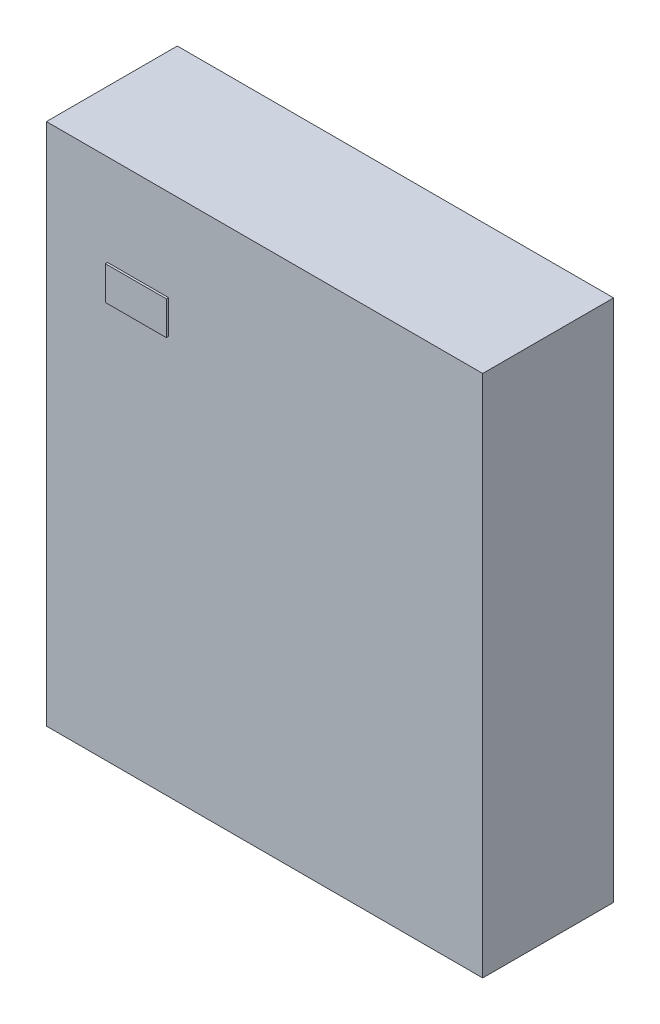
ISO-10303-21;
HEADER;
FILE_DESCRIPTION(('STEP AP214'),'2;1');
FILE_NAME('part.step','',(''),(''),'','','');
FILE_SCHEMA(('AUTOMOTIVE_DESIGN { 1 0 10303 214 1 1 1 1 }'));
ENDSEC;
DATA;
#1=APPLICATION_CONTEXT('core data for automotive mechanical design processes');
#2=APPLICATION_PROTOCOL_DEFINITION('international standard','automotive_design',2000,#1);
#3=PRODUCT_CONTEXT('',#1,'mechanical');
#4=PRODUCT('Part','Part','',(#3));
#5=PRODUCT_RELATED_PRODUCT_CATEGORY('part','',(#4));
#6=PRODUCT_DEFINITION_FORMATION('','',#4);
#7=PRODUCT_DEFINITION_CONTEXT('part definition',#1,'design');
#8=PRODUCT_DEFINITION('design','',#6,#7);
#9=PRODUCT_DEFINITION_SHAPE('','',#8);
#10=(LENGTH_UNIT() NAMED_UNIT(*) SI_UNIT(.MILLI.,.METRE.));
#11=(NAMED_UNIT(*) PLANE_ANGLE_UNIT() SI_UNIT($,.RADIAN.));
#12=(NAMED_UNIT(*) SI_UNIT($,.STERADIAN.) SOLID_ANGLE_UNIT());
#13=UNCERTAINTY_MEASURE_WITH_UNIT(LENGTH_MEASURE(1.E-05),#10,'distance_accuracy_value','');
#14=(GEOMETRIC_REPRESENTATION_CONTEXT(3) GLOBAL_UNCERTAINTY_ASSIGNED_CONTEXT((#13)) GLOBAL_UNIT_ASSIGNED_CONTEXT((#10,
#11,#12)) REPRESENTATION_CONTEXT('',''));
#15=CARTESIAN_POINT('',(0.,0.,0.));
#16=DIRECTION('',(0.,0.,1.));
#17=DIRECTION('',(1.,0.,0.));
#18=AXIS2_PLACEMENT_3D('',#15,#16,#17);
#19=CARTESIAN_POINT('',(-500.,1200.,300.));
#20=DIRECTION('',(0.,0.,-1.));
#21=DIRECTION('',(-1.,0.,0.));
#22=AXIS2_PLACEMENT_3D('',#19,#20,#21);
#23=PLANE('',#22);
#24=DIRECTION('',(1.,0.,0.));
#25=VECTOR('',#24,1.);
#26=CARTESIAN_POINT('',(-500.,0.,300.));
#27=LINE('',#26,#25);
#28=CARTESIAN_POINT('',(-500.,0.,300.));
#29=VERTEX_POINT('',#28);
#30=CARTESIAN_POINT('',(500.,0.,300.));
#31=VERTEX_POINT('',#30);
#32=EDGE_CURVE('E388',#29,#31,#27,.T.);
#33=ORIENTED_EDGE('',*,*,#32,.T.);
#34=DIRECTION('',(0.,-1.,0.));
#35=VECTOR('',#34,1.);
#36=CARTESIAN_POINT('',(500.,1200.,300.));
#37=LINE('',#36,#35);
#38=CARTESIAN_POINT('',(500.,1200.,300.));
#39=VERTEX_POINT('',#38);
#40=EDGE_CURVE('E40',#39,#31,#37,.T.);
#41=ORIENTED_EDGE('',*,*,#40,.F.);
#42=DIRECTION('',(1.,0.,0.));
#43=VECTOR('',#42,1.);
#44=CARTESIAN_POINT('',(-500.,1200.,300.));
#45=LINE('',#44,#43);
#46=CARTESIAN_POINT('',(-500.,1200.,300.));
#47=VERTEX_POINT('',#46);
#48=EDGE_CURVE('E397',#47,#39,#45,.T.);
#49=ORIENTED_EDGE('',*,*,#48,.F.);
#50=DIRECTION('',(0.,-1.,0.));
#51=VECTOR('',#50,1.);
#52=CARTESIAN_POINT('',(-500.,1200.,300.));
#53=LINE('',#52,#51);
#54=EDGE_CURVE('E11',#47,#29,#53,.T.);
#55=ORIENTED_EDGE('',*,*,#54,.T.);
#56=EDGE_LOOP('',(#33,#41,#49,#55));
#57=FACE_BOUND('',#56,.T.);
#58=DIRECTION('',(0.,-1.,0.));
#59=VECTOR('',#58,1.);
#60=CARTESIAN_POINT('',(-360.,990.5,300.));
#61=LINE('',#60,#59);
#62=CARTESIAN_POINT('',(-360.,990.5,300.));
#63=VERTEX_POINT('',#62);
#64=CARTESIAN_POINT('',(-360.,913.5,300.));
#65=VERTEX_POINT('',#64);
#66=EDGE_CURVE('E201',#63,#65,#61,.T.);
#67=ORIENTED_EDGE('',*,*,#66,.F.);
#68=DIRECTION('',(-1.,0.,0.));
#69=VECTOR('',#68,1.);
#70=CARTESIAN_POINT('',(-360.,990.5,300.));
#71=LINE('',#70,#69);
#72=CARTESIAN_POINT('',(-220.,990.5,300.));
#73=VERTEX_POINT('',#72);
#74=EDGE_CURVE('E203',#73,#63,#71,.T.);
#75=ORIENTED_EDGE('',*,*,#74,.F.);
#76=DIRECTION('',(0.,1.,0.));
#77=VECTOR('',#76,1.);
#78=CARTESIAN_POINT('',(-220.,990.5,300.));
#79=LINE('',#78,#77);
#80=CARTESIAN_POINT('',(-220.,913.5,300.));
#81=VERTEX_POINT('',#80);
#82=EDGE_CURVE('E52',#81,#73,#79,.T.);
#83=ORIENTED_EDGE('',*,*,#82,.F.);
#84=DIRECTION('',(1.,0.,0.));
#85=VECTOR('',#84,1.);
#86=CARTESIAN_POINT('',(-360.,913.5,300.));
#87=LINE('',#86,#85);
#88=EDGE_CURVE('E47',#65,#81,#87,.T.);
#89=ORIENTED_EDGE('',*,*,#88,.F.);
#90=EDGE_LOOP('',(#67,#75,#83,#89));
#91=FACE_BOUND('',#90,.T.);
#92=ADVANCED_FACE('F32',(#57,#91),#23,.F.);
#93=CARTESIAN_POINT('',(-500.,1200.,0.));
#94=DIRECTION('',(1.,0.,0.));
#95=DIRECTION('',(0.,0.,-1.));
#96=AXIS2_PLACEMENT_3D('',#93,#94,#95);
#97=PLANE('',#96);
#98=DIRECTION('',(0.,0.,1.));
#99=VECTOR('',#98,1.);
#100=CARTESIAN_POINT('',(-500.,0.,0.));
#101=LINE('',#100,#99);
#102=CARTESIAN_POINT('',(-500.,0.,0.));
#103=VERTEX_POINT('',#102);
#104=EDGE_CURVE('E385',#103,#29,#101,.T.);
#105=ORIENTED_EDGE('',*,*,#104,.T.);
#106=ORIENTED_EDGE('',*,*,#54,.F.);
#107=DIRECTION('',(0.,0.,1.));
#108=VECTOR('',#107,1.);
#109=CARTESIAN_POINT('',(-500.,1200.,0.));
#110=LINE('',#109,#108);
#111=CARTESIAN_POINT('',(-500.,1200.,0.));
#112=VERTEX_POINT('',#111);
#113=EDGE_CURVE('E394',#112,#47,#110,.T.);
#114=ORIENTED_EDGE('',*,*,#113,.F.);
#115=DIRECTION('',(0.,-1.,0.));
#116=VECTOR('',#115,1.);
#117=CARTESIAN_POINT('',(-500.,1200.,0.));
#118=LINE('',#117,#116);
#119=EDGE_CURVE('E403',#112,#103,#118,.T.);
#120=ORIENTED_EDGE('',*,*,#119,.T.);
#121=EDGE_LOOP('',(#105,#106,#114,#120));
#122=FACE_BOUND('',#121,.T.);
#123=ADVANCED_FACE('F34',(#122),#97,.F.);
#124=CARTESIAN_POINT('',(500.,1200.,0.));
#125=DIRECTION('',(-1.,0.,0.));
#126=DIRECTION('',(0.,0.,1.));
#127=AXIS2_PLACEMENT_3D('',#124,#125,#126);
#128=PLANE('',#127);
#129=DIRECTION('',(0.,0.,-1.));
#130=VECTOR('',#129,1.);
#131=CARTESIAN_POINT('',(500.,0.,0.));
#132=LINE('',#131,#130);
#133=CARTESIAN_POINT('',(500.,0.,0.));
#134=VERTEX_POINT('',#133);
#135=EDGE_CURVE('E390',#31,#134,#132,.T.);
#136=ORIENTED_EDGE('',*,*,#135,.T.);
#137=DIRECTION('',(0.,-1.,0.));
#138=VECTOR('',#137,1.);
#139=CARTESIAN_POINT('',(500.,1200.,0.));
#140=LINE('',#139,#138);
#141=CARTESIAN_POINT('',(500.,1200.,0.));
#142=VERTEX_POINT('',#141);
#143=EDGE_CURVE('E406',#142,#134,#140,.T.);
#144=ORIENTED_EDGE('',*,*,#143,.F.);
#145=DIRECTION('',(0.,0.,-1.));
#146=VECTOR('',#145,1.);
#147=CARTESIAN_POINT('',(500.,1200.,0.));
#148=LINE('',#147,#146);
#149=EDGE_CURVE('E399',#39,#142,#148,.T.);
#150=ORIENTED_EDGE('',*,*,#149,.F.);
#151=ORIENTED_EDGE('',*,*,#40,.T.);
#152=EDGE_LOOP('',(#136,#144,#150,#151));
#153=FACE_BOUND('',#152,.T.);
#154=ADVANCED_FACE('F413',(#153),#128,.F.);
#155=CARTESIAN_POINT('',(-500.,1200.,0.));
#156=DIRECTION('',(0.,0.,1.));
#157=DIRECTION('',(1.,0.,0.));
#158=AXIS2_PLACEMENT_3D('',#155,#156,#157);
#159=PLANE('',#158);
#160=CARTESIAN_POINT('',(477.5,1177.5,0.));
#161=DIRECTION('',(0.,0.,-1.));
#162=DIRECTION('',(-1.,0.,0.));
#163=AXIS2_PLACEMENT_3D('',#160,#161,#162);
#164=CIRCLE('',#163,5.);
#165=CARTESIAN_POINT('',(472.5,1177.5,0.));
#166=VERTEX_POINT('',#165);
#167=EDGE_CURVE('E364',#166,#166,#164,.T.);
#168=ORIENTED_EDGE('',*,*,#167,.F.);
#169=EDGE_LOOP('',(#168));
#170=FACE_BOUND('',#169,.T.);
#171=CARTESIAN_POINT('',(-477.5,1177.5,0.));
#172=DIRECTION('',(0.,0.,-1.));
#173=DIRECTION('',(-1.,0.,0.));
#174=AXIS2_PLACEMENT_3D('',#171,#172,#173);
#175=CIRCLE('',#174,5.);
#176=CARTESIAN_POINT('',(-482.5,1177.5,0.));
#177=VERTEX_POINT('',#176);
#178=EDGE_CURVE('E370',#177,#177,#175,.T.);
#179=ORIENTED_EDGE('',*,*,#178,.F.);
#180=EDGE_LOOP('',(#179));
#181=FACE_BOUND('',#180,.T.);
#182=CARTESIAN_POINT('',(-477.5,22.5,0.));
#183=DIRECTION('',(0.,0.,-1.));
#184=DIRECTION('',(-1.,0.,0.));
#185=AXIS2_PLACEMENT_3D('',#182,#183,#184);
#186=CIRCLE('',#185,5.);
#187=CARTESIAN_POINT('',(-482.5,22.5,0.));
#188=VERTEX_POINT('',#187);
#189=EDGE_CURVE('E376',#188,#188,#186,.T.);
#190=ORIENTED_EDGE('',*,*,#189,.F.);
#191=EDGE_LOOP('',(#190));
#192=FACE_BOUND('',#191,.T.);
#193=CARTESIAN_POINT('',(477.5,22.5,0.));
#194=DIRECTION('',(0.,0.,-1.));
#195=DIRECTION('',(-1.,0.,0.));
#196=AXIS2_PLACEMENT_3D('',#193,#194,#195);
#197=CIRCLE('',#196,5.);
#198=CARTESIAN_POINT('',(472.5,22.5,0.));
#199=VERTEX_POINT('',#198);
#200=EDGE_CURVE('E382',#199,#199,#197,.T.);
#201=ORIENTED_EDGE('',*,*,#200,.F.);
#202=EDGE_LOOP('',(#201));
#203=FACE_BOUND('',#202,.T.);
#204=DIRECTION('',(-1.,0.,0.));
#205=VECTOR('',#204,1.);
#206=CARTESIAN_POINT('',(-500.,0.,0.));
#207=LINE('',#206,#205);
#208=EDGE_CURVE('E392',#134,#103,#207,.T.);
#209=ORIENTED_EDGE('',*,*,#208,.T.);
#210=ORIENTED_EDGE('',*,*,#119,.F.);
#211=DIRECTION('',(-1.,0.,0.));
#212=VECTOR('',#211,1.);
#213=CARTESIAN_POINT('',(-500.,1200.,0.));
#214=LINE('',#213,#212);
#215=EDGE_CURVE('E401',#142,#112,#214,.T.);
#216=ORIENTED_EDGE('',*,*,#215,.F.);
#217=ORIENTED_EDGE('',*,*,#143,.T.);
#218=EDGE_LOOP('',(#209,#210,#216,#217));
#219=FACE_BOUND('',#218,.T.);
#220=ADVANCED_FACE('F422',(#170,#181,#192,#203,#219),#159,.F.);
#221=CARTESIAN_POINT('',(-500.,1200.,300.));
#222=DIRECTION('',(0.,1.,0.));
#223=DIRECTION('',(0.,0.,1.));
#224=AXIS2_PLACEMENT_3D('',#221,#222,#223);
#225=PLANE('',#224);
#226=ORIENTED_EDGE('',*,*,#113,.T.);
#227=ORIENTED_EDGE('',*,*,#48,.T.);
#228=ORIENTED_EDGE('',*,*,#149,.T.);
#229=ORIENTED_EDGE('',*,*,#215,.T.);
#230=EDGE_LOOP('',(#226,#227,#228,#229));
#231=FACE_BOUND('',#230,.T.);
#232=ADVANCED_FACE('F428',(#231),#225,.T.);
#233=CARTESIAN_POINT('',(-500.,0.,300.));
#234=DIRECTION('',(0.,1.,0.));
#235=DIRECTION('',(0.,0.,1.));
#236=AXIS2_PLACEMENT_3D('',#233,#234,#235);
#237=PLANE('',#236);
#238=DIRECTION('',(0.,0.,1.));
#239=VECTOR('',#238,1.);
#240=CARTESIAN_POINT('',(-25.0000000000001,0.,70.));
#241=LINE('',#240,#239);
#242=CARTESIAN_POINT('',(-25.0000000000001,0.,70.));
#243=VERTEX_POINT('',#242);
#244=CARTESIAN_POINT('',(-25.0000000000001,0.,155.));
#245=VERTEX_POINT('',#244);
#246=EDGE_CURVE('E235',#243,#245,#241,.T.);
#247=ORIENTED_EDGE('',*,*,#246,.F.);
#248=CARTESIAN_POINT('',(-50.0000000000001,0.,70.));
#249=DIRECTION('',(0.,-1.,0.));
#250=DIRECTION('',(0.,0.,-1.));
#251=AXIS2_PLACEMENT_3D('',#248,#249,#250);
#252=CIRCLE('',#251,25.);
#253=CARTESIAN_POINT('',(-50.0000000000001,0.,45.));
#254=VERTEX_POINT('',#253);
#255=EDGE_CURVE('E233',#254,#243,#252,.T.);
#256=ORIENTED_EDGE('',*,*,#255,.F.);
#257=DIRECTION('',(1.,0.,0.));
#258=VECTOR('',#257,1.);
#259=CARTESIAN_POINT('',(-50.0000000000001,0.,45.));
#260=LINE('',#259,#258);
#261=CARTESIAN_POINT('',(-450.,0.,44.9999999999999));
#262=VERTEX_POINT('',#261);
#263=EDGE_CURVE('E253',#262,#254,#260,.T.);
#264=ORIENTED_EDGE('',*,*,#263,.F.);
#265=CARTESIAN_POINT('',(-450.,0.,69.9999999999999));
#266=DIRECTION('',(0.,-1.,0.));
#267=DIRECTION('',(0.,0.,1.));
#268=AXIS2_PLACEMENT_3D('',#265,#266,#267);
#269=CIRCLE('',#268,25.);
#270=CARTESIAN_POINT('',(-475.,0.,70.));
#271=VERTEX_POINT('',#270);
#272=EDGE_CURVE('E250',#271,#262,#269,.T.);
#273=ORIENTED_EDGE('',*,*,#272,.F.);
#274=DIRECTION('',(0.,0.,-1.));
#275=VECTOR('',#274,1.);
#276=CARTESIAN_POINT('',(-475.,0.,70.0000000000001));
#277=LINE('',#276,#275);
#278=CARTESIAN_POINT('',(-475.,0.,155.));
#279=VERTEX_POINT('',#278);
#280=EDGE_CURVE('E247',#279,#271,#277,.T.);
#281=ORIENTED_EDGE('',*,*,#280,.F.);
#282=CARTESIAN_POINT('',(-450.,0.,155.));
#283=DIRECTION('',(0.,-1.,0.));
#284=DIRECTION('',(0.,0.,-1.));
#285=AXIS2_PLACEMENT_3D('',#282,#283,#284);
#286=CIRCLE('',#285,25.);
#287=CARTESIAN_POINT('',(-450.,0.,180.));
#288=VERTEX_POINT('',#287);
#289=EDGE_CURVE('E244',#288,#279,#286,.T.);
#290=ORIENTED_EDGE('',*,*,#289,.F.);
#291=DIRECTION('',(-1.,0.,0.));
#292=VECTOR('',#291,1.);
#293=CARTESIAN_POINT('',(-50.0000000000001,0.,180.));
#294=LINE('',#293,#292);
#295=CARTESIAN_POINT('',(-50.0000000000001,0.,180.));
#296=VERTEX_POINT('',#295);
#297=EDGE_CURVE('E241',#296,#288,#294,.T.);
#298=ORIENTED_EDGE('',*,*,#297,.F.);
#299=CARTESIAN_POINT('',(-50.0000000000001,0.,155.));
#300=DIRECTION('',(0.,-1.,0.));
#301=DIRECTION('',(0.,0.,-1.));
#302=AXIS2_PLACEMENT_3D('',#299,#300,#301);
#303=CIRCLE('',#302,25.);
#304=EDGE_CURVE('E238',#245,#296,#303,.T.);
#305=ORIENTED_EDGE('',*,*,#304,.F.);
#306=EDGE_LOOP('',(#247,#256,#264,#273,#281,#290,#298,#305));
#307=FACE_BOUND('',#306,.T.);
#308=DIRECTION('',(0.,0.,1.));
#309=VECTOR('',#308,1.);
#310=CARTESIAN_POINT('',(475.,0.,70.0000000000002));
#311=LINE('',#310,#309);
#312=CARTESIAN_POINT('',(475.,0.,70.0000000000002));
#313=VERTEX_POINT('',#312);
#314=CARTESIAN_POINT('',(475.,0.,155.));
#315=VERTEX_POINT('',#314);
#316=EDGE_CURVE('E299',#313,#315,#311,.T.);
#317=ORIENTED_EDGE('',*,*,#316,.F.);
#318=CARTESIAN_POINT('',(450.,0.,70.));
#319=DIRECTION('',(0.,-1.,0.));
#320=DIRECTION('',(0.,0.,-1.));
#321=AXIS2_PLACEMENT_3D('',#318,#319,#320);
#322=CIRCLE('',#321,25.);
#323=CARTESIAN_POINT('',(450.,0.,45.));
#324=VERTEX_POINT('',#323);
#325=EDGE_CURVE('E283',#324,#313,#322,.T.);
#326=ORIENTED_EDGE('',*,*,#325,.F.);
#327=DIRECTION('',(1.,0.,0.));
#328=VECTOR('',#327,1.);
#329=CARTESIAN_POINT('',(450.,0.,45.));
#330=LINE('',#329,#328);
#331=CARTESIAN_POINT('',(49.9999999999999,0.,45.));
#332=VERTEX_POINT('',#331);
#333=EDGE_CURVE('E317',#332,#324,#330,.T.);
#334=ORIENTED_EDGE('',*,*,#333,.F.);
#335=CARTESIAN_POINT('',(49.9999999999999,0.,70.));
#336=DIRECTION('',(0.,-1.,0.));
#337=DIRECTION('',(0.,0.,1.));
#338=AXIS2_PLACEMENT_3D('',#335,#336,#337);
#339=CIRCLE('',#338,25.);
#340=CARTESIAN_POINT('',(24.9999999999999,0.,70.));
#341=VERTEX_POINT('',#340);
#342=EDGE_CURVE('E314',#341,#332,#339,.T.);
#343=ORIENTED_EDGE('',*,*,#342,.F.);
#344=DIRECTION('',(0.,0.,-1.));
#345=VECTOR('',#344,1.);
#346=CARTESIAN_POINT('',(24.9999999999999,0.,70.));
#347=LINE('',#346,#345);
#348=CARTESIAN_POINT('',(24.9999999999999,0.,155.));
#349=VERTEX_POINT('',#348);
#350=EDGE_CURVE('E311',#349,#341,#347,.T.);
#351=ORIENTED_EDGE('',*,*,#350,.F.);
#352=CARTESIAN_POINT('',(50.,0.,155.));
#353=DIRECTION('',(0.,-1.,0.));
#354=DIRECTION('',(0.,0.,-1.));
#355=AXIS2_PLACEMENT_3D('',#352,#353,#354);
#356=CIRCLE('',#355,25.);
#357=CARTESIAN_POINT('',(50.,0.,180.));
#358=VERTEX_POINT('',#357);
#359=EDGE_CURVE('E308',#358,#349,#356,.T.);
#360=ORIENTED_EDGE('',*,*,#359,.F.);
#361=DIRECTION('',(-1.,0.,0.));
#362=VECTOR('',#361,1.);
#363=CARTESIAN_POINT('',(450.,0.,180.));
#364=LINE('',#363,#362);
#365=CARTESIAN_POINT('',(450.,0.,180.));
#366=VERTEX_POINT('',#365);
#367=EDGE_CURVE('E305',#366,#358,#364,.T.);
#368=ORIENTED_EDGE('',*,*,#367,.F.);
#369=CARTESIAN_POINT('',(450.,0.,155.));
#370=DIRECTION('',(0.,-1.,0.));
#371=DIRECTION('',(0.,0.,-1.));
#372=AXIS2_PLACEMENT_3D('',#369,#370,#371);
#373=CIRCLE('',#372,25.);
#374=EDGE_CURVE('E302',#315,#366,#373,.T.);
#375=ORIENTED_EDGE('',*,*,#374,.F.);
#376=EDGE_LOOP('',(#317,#326,#334,#343,#351,#360,#368,#375));
#377=FACE_BOUND('',#376,.T.);
#378=ORIENTED_EDGE('',*,*,#104,.F.);
#379=ORIENTED_EDGE('',*,*,#208,.F.);
#380=ORIENTED_EDGE('',*,*,#135,.F.);
#381=ORIENTED_EDGE('',*,*,#32,.F.);
#382=EDGE_LOOP('',(#378,#379,#380,#381));
#383=FACE_BOUND('',#382,.T.);
#384=ADVANCED_FACE('F419',(#307,#377,#383),#237,.F.);
#385=CARTESIAN_POINT('',(477.5,22.5,0.));
#386=DIRECTION('',(0.,0.,-1.));
#387=DIRECTION('',(-1.,0.,0.));
#388=AXIS2_PLACEMENT_3D('',#385,#386,#387);
#389=CYLINDRICAL_SURFACE('',#388,5.);
#390=CARTESIAN_POINT('',(477.5,22.5,20.));
#391=DIRECTION('',(0.,0.,-1.));
#392=DIRECTION('',(-1.,0.,0.));
#393=AXIS2_PLACEMENT_3D('',#390,#391,#392);
#394=CIRCLE('',#393,5.);
#395=CARTESIAN_POINT('',(472.5,22.5,20.));
#396=VERTEX_POINT('',#395);
#397=EDGE_CURVE('E379',#396,#396,#394,.T.);
#398=ORIENTED_EDGE('',*,*,#397,.F.);
#399=EDGE_LOOP('',(#398));
#400=FACE_BOUND('',#399,.T.);
#401=ORIENTED_EDGE('',*,*,#200,.T.);
#402=EDGE_LOOP('',(#401));
#403=FACE_BOUND('',#402,.T.);
#404=ADVANCED_FACE('F443',(#400,#403),#389,.F.);
#405=CARTESIAN_POINT('',(477.5,22.5,20.));
#406=DIRECTION('',(0.,0.,-1.));
#407=DIRECTION('',(-1.,0.,0.));
#408=AXIS2_PLACEMENT_3D('',#405,#406,#407);
#409=CONICAL_SURFACE('',#408,5.,1.02974425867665);
#410=CARTESIAN_POINT('',(477.5,22.5,23.0043030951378));
#411=VERTEX_POINT('',#410);
#412=VERTEX_LOOP('',#411);
#413=FACE_BOUND('',#412,.T.);
#414=ORIENTED_EDGE('',*,*,#397,.T.);
#415=EDGE_LOOP('',(#414));
#416=FACE_BOUND('',#415,.T.);
#417=ADVANCED_FACE('F447',(#413,#416),#409,.F.);
#418=CARTESIAN_POINT('',(-477.5,22.5,0.));
#419=DIRECTION('',(0.,0.,-1.));
#420=DIRECTION('',(-1.,0.,0.));
#421=AXIS2_PLACEMENT_3D('',#418,#419,#420);
#422=CYLINDRICAL_SURFACE('',#421,5.);
#423=CARTESIAN_POINT('',(-477.5,22.5,20.));
#424=DIRECTION('',(0.,0.,-1.));
#425=DIRECTION('',(-1.,0.,0.));
#426=AXIS2_PLACEMENT_3D('',#423,#424,#425);
#427=CIRCLE('',#426,5.);
#428=CARTESIAN_POINT('',(-482.5,22.5,20.));
#429=VERTEX_POINT('',#428);
#430=EDGE_CURVE('E373',#429,#429,#427,.T.);
#431=ORIENTED_EDGE('',*,*,#430,.F.);
#432=EDGE_LOOP('',(#431));
#433=FACE_BOUND('',#432,.T.);
#434=ORIENTED_EDGE('',*,*,#189,.T.);
#435=EDGE_LOOP('',(#434));
#436=FACE_BOUND('',#435,.T.);
#437=ADVANCED_FACE('F451',(#433,#436),#422,.F.);
#438=CARTESIAN_POINT('',(-477.5,22.5,20.));
#439=DIRECTION('',(0.,0.,-1.));
#440=DIRECTION('',(-1.,0.,0.));
#441=AXIS2_PLACEMENT_3D('',#438,#439,#440);
#442=CONICAL_SURFACE('',#441,5.,1.02974425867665);
#443=CARTESIAN_POINT('',(-477.5,22.5,23.0043030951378));
#444=VERTEX_POINT('',#443);
#445=VERTEX_LOOP('',#444);
#446=FACE_BOUND('',#445,.T.);
#447=ORIENTED_EDGE('',*,*,#430,.T.);
#448=EDGE_LOOP('',(#447));
#449=FACE_BOUND('',#448,.T.);
#450=ADVANCED_FACE('F455',(#446,#449),#442,.F.);
#451=CARTESIAN_POINT('',(-477.5,1177.5,0.));
#452=DIRECTION('',(0.,0.,-1.));
#453=DIRECTION('',(-1.,0.,0.));
#454=AXIS2_PLACEMENT_3D('',#451,#452,#453);
#455=CYLINDRICAL_SURFACE('',#454,5.);
#456=CARTESIAN_POINT('',(-477.5,1177.5,20.));
#457=DIRECTION('',(0.,0.,-1.));
#458=DIRECTION('',(-1.,0.,0.));
#459=AXIS2_PLACEMENT_3D('',#456,#457,#458);
#460=CIRCLE('',#459,5.);
#461=CARTESIAN_POINT('',(-482.5,1177.5,20.));
#462=VERTEX_POINT('',#461);
#463=EDGE_CURVE('E367',#462,#462,#460,.T.);
#464=ORIENTED_EDGE('',*,*,#463,.F.);
#465=EDGE_LOOP('',(#464));
#466=FACE_BOUND('',#465,.T.);
#467=ORIENTED_EDGE('',*,*,#178,.T.);
#468=EDGE_LOOP('',(#467));
#469=FACE_BOUND('',#468,.T.);
#470=ADVANCED_FACE('F459',(#466,#469),#455,.F.);
#471=CARTESIAN_POINT('',(-477.5,1177.5,20.));
#472=DIRECTION('',(0.,0.,-1.));
#473=DIRECTION('',(-1.,0.,0.));
#474=AXIS2_PLACEMENT_3D('',#471,#472,#473);
#475=CONICAL_SURFACE('',#474,5.,1.02974425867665);
#476=CARTESIAN_POINT('',(-477.5,1177.5,23.0043030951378));
#477=VERTEX_POINT('',#476);
#478=VERTEX_LOOP('',#477);
#479=FACE_BOUND('',#478,.T.);
#480=ORIENTED_EDGE('',*,*,#463,.T.);
#481=EDGE_LOOP('',(#480));
#482=FACE_BOUND('',#481,.T.);
#483=ADVANCED_FACE('F463',(#479,#482),#475,.F.);
#484=CARTESIAN_POINT('',(477.5,1177.5,0.));
#485=DIRECTION('',(0.,0.,-1.));
#486=DIRECTION('',(-1.,0.,0.));
#487=AXIS2_PLACEMENT_3D('',#484,#485,#486);
#488=CYLINDRICAL_SURFACE('',#487,5.);
#489=CARTESIAN_POINT('',(477.5,1177.5,20.));
#490=DIRECTION('',(0.,0.,-1.));
#491=DIRECTION('',(-1.,0.,0.));
#492=AXIS2_PLACEMENT_3D('',#489,#490,#491);
#493=CIRCLE('',#492,5.);
#494=CARTESIAN_POINT('',(472.5,1177.5,20.));
#495=VERTEX_POINT('',#494);
#496=EDGE_CURVE('E347',#495,#495,#493,.T.);
#497=ORIENTED_EDGE('',*,*,#496,.F.);
#498=EDGE_LOOP('',(#497));
#499=FACE_BOUND('',#498,.T.);
#500=ORIENTED_EDGE('',*,*,#167,.T.);
#501=EDGE_LOOP('',(#500));
#502=FACE_BOUND('',#501,.T.);
#503=ADVANCED_FACE('F467',(#499,#502),#488,.F.);
#504=CARTESIAN_POINT('',(477.5,1177.5,20.));
#505=DIRECTION('',(0.,0.,-1.));
#506=DIRECTION('',(-1.,0.,0.));
#507=AXIS2_PLACEMENT_3D('',#504,#505,#506);
#508=CONICAL_SURFACE('',#507,5.,1.02974425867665);
#509=CARTESIAN_POINT('',(477.5,1177.5,23.0043030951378));
#510=VERTEX_POINT('',#509);
#511=VERTEX_LOOP('',#510);
#512=FACE_BOUND('',#511,.T.);
#513=ORIENTED_EDGE('',*,*,#496,.T.);
#514=EDGE_LOOP('',(#513));
#515=FACE_BOUND('',#514,.T.);
#516=ADVANCED_FACE('F471',(#512,#515),#508,.F.);
#517=CARTESIAN_POINT('',(450.,3.,70.));
#518=DIRECTION('',(0.,-1.,0.));
#519=DIRECTION('',(0.,0.,-1.));
#520=AXIS2_PLACEMENT_3D('',#517,#518,#519);
#521=CYLINDRICAL_SURFACE('',#520,25.);
#522=ORIENTED_EDGE('',*,*,#325,.T.);
#523=DIRECTION('',(0.,-1.,0.));
#524=VECTOR('',#523,1.);
#525=CARTESIAN_POINT('',(475.,3.,70.0000000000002));
#526=LINE('',#525,#524);
#527=CARTESIAN_POINT('',(475.,3.,70.0000000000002));
#528=VERTEX_POINT('',#527);
#529=EDGE_CURVE('E344',#528,#313,#526,.T.);
#530=ORIENTED_EDGE('',*,*,#529,.F.);
#531=CARTESIAN_POINT('',(450.,3.,70.));
#532=DIRECTION('',(0.,-1.,0.));
#533=DIRECTION('',(0.,0.,-1.));
#534=AXIS2_PLACEMENT_3D('',#531,#532,#533);
#535=CIRCLE('',#534,25.);
#536=CARTESIAN_POINT('',(450.,3.,45.));
#537=VERTEX_POINT('',#536);
#538=EDGE_CURVE('E320',#537,#528,#535,.T.);
#539=ORIENTED_EDGE('',*,*,#538,.F.);
#540=DIRECTION('',(0.,-1.,0.));
#541=VECTOR('',#540,1.);
#542=CARTESIAN_POINT('',(450.,3.,45.));
#543=LINE('',#542,#541);
#544=EDGE_CURVE('E345',#537,#324,#543,.T.);
#545=ORIENTED_EDGE('',*,*,#544,.T.);
#546=EDGE_LOOP('',(#522,#530,#539,#545));
#547=FACE_BOUND('',#546,.T.);
#548=ADVANCED_FACE('F475',(#547),#521,.F.);
#549=CARTESIAN_POINT('',(450.,3.,45.));
#550=DIRECTION('',(0.,0.,-1.));
#551=DIRECTION('',(-1.,0.,0.));
#552=AXIS2_PLACEMENT_3D('',#549,#550,#551);
#553=PLANE('',#552);
#554=ORIENTED_EDGE('',*,*,#333,.T.);
#555=ORIENTED_EDGE('',*,*,#544,.F.);
#556=DIRECTION('',(1.,0.,0.));
#557=VECTOR('',#556,1.);
#558=CARTESIAN_POINT('',(450.,3.,45.));
#559=LINE('',#558,#557);
#560=CARTESIAN_POINT('',(49.9999999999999,3.,45.));
#561=VERTEX_POINT('',#560);
#562=EDGE_CURVE('E341',#561,#537,#559,.T.);
#563=ORIENTED_EDGE('',*,*,#562,.F.);
#564=DIRECTION('',(0.,-1.,0.));
#565=VECTOR('',#564,1.);
#566=CARTESIAN_POINT('',(49.9999999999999,3.,45.));
#567=LINE('',#566,#565);
#568=EDGE_CURVE('E348',#561,#332,#567,.T.);
#569=ORIENTED_EDGE('',*,*,#568,.T.);
#570=EDGE_LOOP('',(#554,#555,#563,#569));
#571=FACE_BOUND('',#570,.T.);
#572=ADVANCED_FACE('F479',(#571),#553,.F.);
#573=CARTESIAN_POINT('',(49.9999999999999,3.,70.));
#574=DIRECTION('',(0.,-1.,0.));
#575=DIRECTION('',(0.,0.,-1.));
#576=AXIS2_PLACEMENT_3D('',#573,#574,#575);
#577=CYLINDRICAL_SURFACE('',#576,25.);
#578=ORIENTED_EDGE('',*,*,#342,.T.);
#579=ORIENTED_EDGE('',*,*,#568,.F.);
#580=CARTESIAN_POINT('',(49.9999999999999,3.,70.));
#581=DIRECTION('',(0.,-1.,0.));
#582=DIRECTION('',(0.,0.,1.));
#583=AXIS2_PLACEMENT_3D('',#580,#581,#582);
#584=CIRCLE('',#583,25.);
#585=CARTESIAN_POINT('',(24.9999999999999,3.,70.));
#586=VERTEX_POINT('',#585);
#587=EDGE_CURVE('E338',#586,#561,#584,.T.);
#588=ORIENTED_EDGE('',*,*,#587,.F.);
#589=DIRECTION('',(0.,-1.,0.));
#590=VECTOR('',#589,1.);
#591=CARTESIAN_POINT('',(24.9999999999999,3.,70.));
#592=LINE('',#591,#590);
#593=EDGE_CURVE('E350',#586,#341,#592,.T.);
#594=ORIENTED_EDGE('',*,*,#593,.T.);
#595=EDGE_LOOP('',(#578,#579,#588,#594));
#596=FACE_BOUND('',#595,.T.);
#597=ADVANCED_FACE('F501',(#596),#577,.F.);
#598=CARTESIAN_POINT('',(24.9999999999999,3.,70.));
#599=DIRECTION('',(-1.,0.,0.));
#600=DIRECTION('',(0.,0.,1.));
#601=AXIS2_PLACEMENT_3D('',#598,#599,#600);
#602=PLANE('',#601);
#603=ORIENTED_EDGE('',*,*,#350,.T.);
#604=ORIENTED_EDGE('',*,*,#593,.F.);
#605=DIRECTION('',(0.,0.,-1.));
#606=VECTOR('',#605,1.);
#607=CARTESIAN_POINT('',(24.9999999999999,3.,70.));
#608=LINE('',#607,#606);
#609=CARTESIAN_POINT('',(24.9999999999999,3.,155.));
#610=VERTEX_POINT('',#609);
#611=EDGE_CURVE('E335',#610,#586,#608,.T.);
#612=ORIENTED_EDGE('',*,*,#611,.F.);
#613=DIRECTION('',(0.,-1.,0.));
#614=VECTOR('',#613,1.);
#615=CARTESIAN_POINT('',(24.9999999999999,3.,155.));
#616=LINE('',#615,#614);
#617=EDGE_CURVE('E352',#610,#349,#616,.T.);
#618=ORIENTED_EDGE('',*,*,#617,.T.);
#619=EDGE_LOOP('',(#603,#604,#612,#618));
#620=FACE_BOUND('',#619,.T.);
#621=ADVANCED_FACE('F497',(#620),#602,.F.);
#622=CARTESIAN_POINT('',(50.,3.,155.));
#623=DIRECTION('',(0.,-1.,0.));
#624=DIRECTION('',(0.,0.,-1.));
#625=AXIS2_PLACEMENT_3D('',#622,#623,#624);
#626=CYLINDRICAL_SURFACE('',#625,25.);
#627=ORIENTED_EDGE('',*,*,#359,.T.);
#628=ORIENTED_EDGE('',*,*,#617,.F.);
#629=CARTESIAN_POINT('',(50.,3.,155.));
#630=DIRECTION('',(0.,-1.,0.));
#631=DIRECTION('',(0.,0.,-1.));
#632=AXIS2_PLACEMENT_3D('',#629,#630,#631);
#633=CIRCLE('',#632,25.);
#634=CARTESIAN_POINT('',(50.,3.,180.));
#635=VERTEX_POINT('',#634);
#636=EDGE_CURVE('E332',#635,#610,#633,.T.);
#637=ORIENTED_EDGE('',*,*,#636,.F.);
#638=DIRECTION('',(0.,-1.,0.));
#639=VECTOR('',#638,1.);
#640=CARTESIAN_POINT('',(50.,3.,180.));
#641=LINE('',#640,#639);
#642=EDGE_CURVE('E354',#635,#358,#641,.T.);
#643=ORIENTED_EDGE('',*,*,#642,.T.);
#644=EDGE_LOOP('',(#627,#628,#637,#643));
#645=FACE_BOUND('',#644,.T.);
#646=ADVANCED_FACE('F493',(#645),#626,.F.);
#647=CARTESIAN_POINT('',(450.,3.,180.));
#648=DIRECTION('',(0.,0.,1.));
#649=DIRECTION('',(1.,0.,0.));
#650=AXIS2_PLACEMENT_3D('',#647,#648,#649);
#651=PLANE('',#650);
#652=ORIENTED_EDGE('',*,*,#367,.T.);
#653=ORIENTED_EDGE('',*,*,#642,.F.);
#654=DIRECTION('',(-1.,0.,0.));
#655=VECTOR('',#654,1.);
#656=CARTESIAN_POINT('',(450.,3.,180.));
#657=LINE('',#656,#655);
#658=CARTESIAN_POINT('',(450.,3.,180.));
#659=VERTEX_POINT('',#658);
#660=EDGE_CURVE('E329',#659,#635,#657,.T.);
#661=ORIENTED_EDGE('',*,*,#660,.F.);
#662=DIRECTION('',(0.,-1.,0.));
#663=VECTOR('',#662,1.);
#664=CARTESIAN_POINT('',(450.,3.,180.));
#665=LINE('',#664,#663);
#666=EDGE_CURVE('E356',#659,#366,#665,.T.);
#667=ORIENTED_EDGE('',*,*,#666,.T.);
#668=EDGE_LOOP('',(#652,#653,#661,#667));
#669=FACE_BOUND('',#668,.T.);
#670=ADVANCED_FACE('F489',(#669),#651,.F.);
#671=CARTESIAN_POINT('',(450.,3.,155.));
#672=DIRECTION('',(0.,-1.,0.));
#673=DIRECTION('',(0.,0.,-1.));
#674=AXIS2_PLACEMENT_3D('',#671,#672,#673);
#675=CYLINDRICAL_SURFACE('',#674,25.);
#676=ORIENTED_EDGE('',*,*,#374,.T.);
#677=ORIENTED_EDGE('',*,*,#666,.F.);
#678=CARTESIAN_POINT('',(450.,3.,155.));
#679=DIRECTION('',(0.,-1.,0.));
#680=DIRECTION('',(0.,0.,-1.));
#681=AXIS2_PLACEMENT_3D('',#678,#679,#680);
#682=CIRCLE('',#681,25.);
#683=CARTESIAN_POINT('',(475.,3.,155.));
#684=VERTEX_POINT('',#683);
#685=EDGE_CURVE('E326',#684,#659,#682,.T.);
#686=ORIENTED_EDGE('',*,*,#685,.F.);
#687=DIRECTION('',(0.,-1.,0.));
#688=VECTOR('',#687,1.);
#689=CARTESIAN_POINT('',(475.,3.,155.));
#690=LINE('',#689,#688);
#691=EDGE_CURVE('E358',#684,#315,#690,.T.);
#692=ORIENTED_EDGE('',*,*,#691,.T.);
#693=EDGE_LOOP('',(#676,#677,#686,#692));
#694=FACE_BOUND('',#693,.T.);
#695=ADVANCED_FACE('F485',(#694),#675,.F.);
#696=CARTESIAN_POINT('',(475.,3.,70.0000000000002));
#697=DIRECTION('',(1.,0.,0.));
#698=DIRECTION('',(0.,0.,-1.));
#699=AXIS2_PLACEMENT_3D('',#696,#697,#698);
#700=PLANE('',#699);
#701=ORIENTED_EDGE('',*,*,#316,.T.);
#702=ORIENTED_EDGE('',*,*,#691,.F.);
#703=DIRECTION('',(0.,0.,1.));
#704=VECTOR('',#703,1.);
#705=CARTESIAN_POINT('',(475.,3.,70.0000000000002));
#706=LINE('',#705,#704);
#707=EDGE_CURVE('E323',#528,#684,#706,.T.);
#708=ORIENTED_EDGE('',*,*,#707,.F.);
#709=ORIENTED_EDGE('',*,*,#529,.T.);
#710=EDGE_LOOP('',(#701,#702,#708,#709));
#711=FACE_BOUND('',#710,.T.);
#712=ADVANCED_FACE('F481',(#711),#700,.F.);
#713=CARTESIAN_POINT('',(450.,3.,70.));
#714=DIRECTION('',(0.,-1.,0.));
#715=DIRECTION('',(0.,0.,-1.));
#716=AXIS2_PLACEMENT_3D('',#713,#714,#715);
#717=PLANE('',#716);
#718=ORIENTED_EDGE('',*,*,#538,.T.);
#719=ORIENTED_EDGE('',*,*,#707,.T.);
#720=ORIENTED_EDGE('',*,*,#685,.T.);
#721=ORIENTED_EDGE('',*,*,#660,.T.);
#722=ORIENTED_EDGE('',*,*,#636,.T.);
#723=ORIENTED_EDGE('',*,*,#611,.T.);
#724=ORIENTED_EDGE('',*,*,#587,.T.);
#725=ORIENTED_EDGE('',*,*,#562,.T.);
#726=EDGE_LOOP('',(#718,#719,#720,#721,#722,#723,#724,#725));
#727=FACE_BOUND('',#726,.T.);
#728=ADVANCED_FACE('F484',(#727),#717,.T.);
#729=CARTESIAN_POINT('',(-50.0000000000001,3.,70.));
#730=DIRECTION('',(0.,-1.,0.));
#731=DIRECTION('',(0.,0.,-1.));
#732=AXIS2_PLACEMENT_3D('',#729,#730,#731);
#733=CYLINDRICAL_SURFACE('',#732,25.);
#734=ORIENTED_EDGE('',*,*,#255,.T.);
#735=DIRECTION('',(0.,-1.,0.));
#736=VECTOR('',#735,1.);
#737=CARTESIAN_POINT('',(-25.0000000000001,3.,70.));
#738=LINE('',#737,#736);
#739=CARTESIAN_POINT('',(-25.0000000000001,3.,70.));
#740=VERTEX_POINT('',#739);
#741=EDGE_CURVE('E280',#740,#243,#738,.T.);
#742=ORIENTED_EDGE('',*,*,#741,.F.);
#743=CARTESIAN_POINT('',(-50.0000000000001,3.,70.));
#744=DIRECTION('',(0.,-1.,0.));
#745=DIRECTION('',(0.,0.,-1.));
#746=AXIS2_PLACEMENT_3D('',#743,#744,#745);
#747=CIRCLE('',#746,25.);
#748=CARTESIAN_POINT('',(-50.0000000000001,3.,45.));
#749=VERTEX_POINT('',#748);
#750=EDGE_CURVE('E256',#749,#740,#747,.T.);
#751=ORIENTED_EDGE('',*,*,#750,.F.);
#752=DIRECTION('',(0.,-1.,0.));
#753=VECTOR('',#752,1.);
#754=CARTESIAN_POINT('',(-50.0000000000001,3.,45.));
#755=LINE('',#754,#753);
#756=EDGE_CURVE('E281',#749,#254,#755,.T.);
#757=ORIENTED_EDGE('',*,*,#756,.T.);
#758=EDGE_LOOP('',(#734,#742,#751,#757));
#759=FACE_BOUND('',#758,.T.);
#760=ADVANCED_FACE('F511',(#759),#733,.F.);
#761=CARTESIAN_POINT('',(-50.0000000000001,3.,45.));
#762=DIRECTION('',(0.,0.,-1.));
#763=DIRECTION('',(-1.,0.,0.));
#764=AXIS2_PLACEMENT_3D('',#761,#762,#763);
#765=PLANE('',#764);
#766=ORIENTED_EDGE('',*,*,#263,.T.);
#767=ORIENTED_EDGE('',*,*,#756,.F.);
#768=DIRECTION('',(1.,0.,0.));
#769=VECTOR('',#768,1.);
#770=CARTESIAN_POINT('',(-50.0000000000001,3.,45.));
#771=LINE('',#770,#769);
#772=CARTESIAN_POINT('',(-450.,3.,44.9999999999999));
#773=VERTEX_POINT('',#772);
#774=EDGE_CURVE('E277',#773,#749,#771,.T.);
#775=ORIENTED_EDGE('',*,*,#774,.F.);
#776=DIRECTION('',(0.,-1.,0.));
#777=VECTOR('',#776,1.);
#778=CARTESIAN_POINT('',(-450.,3.,44.9999999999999));
#779=LINE('',#778,#777);
#780=EDGE_CURVE('E284',#773,#262,#779,.T.);
#781=ORIENTED_EDGE('',*,*,#780,.T.);
#782=EDGE_LOOP('',(#766,#767,#775,#781));
#783=FACE_BOUND('',#782,.T.);
#784=ADVANCED_FACE('F515',(#783),#765,.F.);
#785=CARTESIAN_POINT('',(-450.,3.,69.9999999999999));
#786=DIRECTION('',(0.,-1.,0.));
#787=DIRECTION('',(0.,0.,-1.));
#788=AXIS2_PLACEMENT_3D('',#785,#786,#787);
#789=CYLINDRICAL_SURFACE('',#788,25.);
#790=ORIENTED_EDGE('',*,*,#272,.T.);
#791=ORIENTED_EDGE('',*,*,#780,.F.);
#792=CARTESIAN_POINT('',(-450.,3.,69.9999999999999));
#793=DIRECTION('',(0.,-1.,0.));
#794=DIRECTION('',(0.,0.,1.));
#795=AXIS2_PLACEMENT_3D('',#792,#793,#794);
#796=CIRCLE('',#795,25.);
#797=CARTESIAN_POINT('',(-475.,3.,70.));
#798=VERTEX_POINT('',#797);
#799=EDGE_CURVE('E274',#798,#773,#796,.T.);
#800=ORIENTED_EDGE('',*,*,#799,.F.);
#801=DIRECTION('',(0.,-1.,0.));
#802=VECTOR('',#801,1.);
#803=CARTESIAN_POINT('',(-475.,3.,70.));
#804=LINE('',#803,#802);
#805=EDGE_CURVE('E286',#798,#271,#804,.T.);
#806=ORIENTED_EDGE('',*,*,#805,.T.);
#807=EDGE_LOOP('',(#790,#791,#800,#806));
#808=FACE_BOUND('',#807,.T.);
#809=ADVANCED_FACE('F537',(#808),#789,.F.);
#810=CARTESIAN_POINT('',(-475.,3.,70.0000000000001));
#811=DIRECTION('',(-1.,0.,0.));
#812=DIRECTION('',(0.,0.,1.));
#813=AXIS2_PLACEMENT_3D('',#810,#811,#812);
#814=PLANE('',#813);
#815=ORIENTED_EDGE('',*,*,#280,.T.);
#816=ORIENTED_EDGE('',*,*,#805,.F.);
#817=DIRECTION('',(0.,0.,-1.));
#818=VECTOR('',#817,1.);
#819=CARTESIAN_POINT('',(-475.,3.,70.0000000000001));
#820=LINE('',#819,#818);
#821=CARTESIAN_POINT('',(-475.,3.,155.));
#822=VERTEX_POINT('',#821);
#823=EDGE_CURVE('E271',#822,#798,#820,.T.);
#824=ORIENTED_EDGE('',*,*,#823,.F.);
#825=DIRECTION('',(0.,-1.,0.));
#826=VECTOR('',#825,1.);
#827=CARTESIAN_POINT('',(-475.,3.,155.));
#828=LINE('',#827,#826);
#829=EDGE_CURVE('E288',#822,#279,#828,.T.);
#830=ORIENTED_EDGE('',*,*,#829,.T.);
#831=EDGE_LOOP('',(#815,#816,#824,#830));
#832=FACE_BOUND('',#831,.T.);
#833=ADVANCED_FACE('F533',(#832),#814,.F.);
#834=CARTESIAN_POINT('',(-450.,3.,155.));
#835=DIRECTION('',(0.,-1.,0.));
#836=DIRECTION('',(0.,0.,-1.));
#837=AXIS2_PLACEMENT_3D('',#834,#835,#836);
#838=CYLINDRICAL_SURFACE('',#837,25.);
#839=ORIENTED_EDGE('',*,*,#289,.T.);
#840=ORIENTED_EDGE('',*,*,#829,.F.);
#841=CARTESIAN_POINT('',(-450.,3.,155.));
#842=DIRECTION('',(0.,-1.,0.));
#843=DIRECTION('',(0.,0.,-1.));
#844=AXIS2_PLACEMENT_3D('',#841,#842,#843);
#845=CIRCLE('',#844,25.);
#846=CARTESIAN_POINT('',(-450.,3.,180.));
#847=VERTEX_POINT('',#846);
#848=EDGE_CURVE('E268',#847,#822,#845,.T.);
#849=ORIENTED_EDGE('',*,*,#848,.F.);
#850=DIRECTION('',(0.,-1.,0.));
#851=VECTOR('',#850,1.);
#852=CARTESIAN_POINT('',(-450.,3.,180.));
#853=LINE('',#852,#851);
#854=EDGE_CURVE('E290',#847,#288,#853,.T.);
#855=ORIENTED_EDGE('',*,*,#854,.T.);
#856=EDGE_LOOP('',(#839,#840,#849,#855));
#857=FACE_BOUND('',#856,.T.);
#858=ADVANCED_FACE('F529',(#857),#838,.F.);
#859=CARTESIAN_POINT('',(-50.0000000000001,3.,180.));
#860=DIRECTION('',(0.,0.,1.));
#861=DIRECTION('',(1.,0.,0.));
#862=AXIS2_PLACEMENT_3D('',#859,#860,#861);
#863=PLANE('',#862);
#864=ORIENTED_EDGE('',*,*,#297,.T.);
#865=ORIENTED_EDGE('',*,*,#854,.F.);
#866=DIRECTION('',(-1.,0.,0.));
#867=VECTOR('',#866,1.);
#868=CARTESIAN_POINT('',(-50.0000000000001,3.,180.));
#869=LINE('',#868,#867);
#870=CARTESIAN_POINT('',(-50.0000000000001,3.,180.));
#871=VERTEX_POINT('',#870);
#872=EDGE_CURVE('E265',#871,#847,#869,.T.);
#873=ORIENTED_EDGE('',*,*,#872,.F.);
#874=DIRECTION('',(0.,-1.,0.));
#875=VECTOR('',#874,1.);
#876=CARTESIAN_POINT('',(-50.0000000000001,3.,180.));
#877=LINE('',#876,#875);
#878=EDGE_CURVE('E292',#871,#296,#877,.T.);
#879=ORIENTED_EDGE('',*,*,#878,.T.);
#880=EDGE_LOOP('',(#864,#865,#873,#879));
#881=FACE_BOUND('',#880,.T.);
#882=ADVANCED_FACE('F525',(#881),#863,.F.);
#883=CARTESIAN_POINT('',(-50.0000000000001,3.,155.));
#884=DIRECTION('',(0.,-1.,0.));
#885=DIRECTION('',(0.,0.,-1.));
#886=AXIS2_PLACEMENT_3D('',#883,#884,#885);
#887=CYLINDRICAL_SURFACE('',#886,25.);
#888=ORIENTED_EDGE('',*,*,#304,.T.);
#889=ORIENTED_EDGE('',*,*,#878,.F.);
#890=CARTESIAN_POINT('',(-50.0000000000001,3.,155.));
#891=DIRECTION('',(0.,-1.,0.));
#892=DIRECTION('',(0.,0.,-1.));
#893=AXIS2_PLACEMENT_3D('',#890,#891,#892);
#894=CIRCLE('',#893,25.);
#895=CARTESIAN_POINT('',(-25.0000000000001,3.,155.));
#896=VERTEX_POINT('',#895);
#897=EDGE_CURVE('E262',#896,#871,#894,.T.);
#898=ORIENTED_EDGE('',*,*,#897,.F.);
#899=DIRECTION('',(0.,-1.,0.));
#900=VECTOR('',#899,1.);
#901=CARTESIAN_POINT('',(-25.0000000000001,3.,155.));
#902=LINE('',#901,#900);
#903=EDGE_CURVE('E294',#896,#245,#902,.T.);
#904=ORIENTED_EDGE('',*,*,#903,.T.);
#905=EDGE_LOOP('',(#888,#889,#898,#904));
#906=FACE_BOUND('',#905,.T.);
#907=ADVANCED_FACE('F521',(#906),#887,.F.);
#908=CARTESIAN_POINT('',(-25.0000000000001,3.,70.));
#909=DIRECTION('',(1.,0.,0.));
#910=DIRECTION('',(0.,0.,-1.));
#911=AXIS2_PLACEMENT_3D('',#908,#909,#910);
#912=PLANE('',#911);
#913=ORIENTED_EDGE('',*,*,#246,.T.);
#914=ORIENTED_EDGE('',*,*,#903,.F.);
#915=DIRECTION('',(0.,0.,1.));
#916=VECTOR('',#915,1.);
#917=CARTESIAN_POINT('',(-25.0000000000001,3.,70.));
#918=LINE('',#917,#916);
#919=EDGE_CURVE('E259',#740,#896,#918,.T.);
#920=ORIENTED_EDGE('',*,*,#919,.F.);
#921=ORIENTED_EDGE('',*,*,#741,.T.);
#922=EDGE_LOOP('',(#913,#914,#920,#921));
#923=FACE_BOUND('',#922,.T.);
#924=ADVANCED_FACE('F517',(#923),#912,.F.);
#925=CARTESIAN_POINT('',(-50.0000000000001,3.,70.));
#926=DIRECTION('',(0.,-1.,0.));
#927=DIRECTION('',(0.,0.,-1.));
#928=AXIS2_PLACEMENT_3D('',#925,#926,#927);
#929=PLANE('',#928);
#930=ORIENTED_EDGE('',*,*,#750,.T.);
#931=ORIENTED_EDGE('',*,*,#919,.T.);
#932=ORIENTED_EDGE('',*,*,#897,.T.);
#933=ORIENTED_EDGE('',*,*,#872,.T.);
#934=ORIENTED_EDGE('',*,*,#848,.T.);
#935=ORIENTED_EDGE('',*,*,#823,.T.);
#936=ORIENTED_EDGE('',*,*,#799,.T.);
#937=ORIENTED_EDGE('',*,*,#774,.T.);
#938=EDGE_LOOP('',(#930,#931,#932,#933,#934,#935,#936,#937));
#939=FACE_BOUND('',#938,.T.);
#940=ADVANCED_FACE('F520',(#939),#929,.T.);
#941=CARTESIAN_POINT('',(-360.,990.5,305.));
#942=DIRECTION('',(1.,0.,0.));
#943=DIRECTION('',(0.,1.,0.));
#944=AXIS2_PLACEMENT_3D('',#941,#942,#943);
#945=PLANE('',#944);
#946=ORIENTED_EDGE('',*,*,#66,.T.);
#947=DIRECTION('',(0.,0.,-1.));
#948=VECTOR('',#947,1.);
#949=CARTESIAN_POINT('',(-360.,913.5,305.));
#950=LINE('',#949,#948);
#951=CARTESIAN_POINT('',(-360.,913.5,305.));
#952=VERTEX_POINT('',#951);
#953=EDGE_CURVE('E231',#952,#65,#950,.T.);
#954=ORIENTED_EDGE('',*,*,#953,.F.);
#955=DIRECTION('',(0.,-1.,0.));
#956=VECTOR('',#955,1.);
#957=CARTESIAN_POINT('',(-360.,990.5,305.));
#958=LINE('',#957,#956);
#959=CARTESIAN_POINT('',(-360.,990.5,305.));
#960=VERTEX_POINT('',#959);
#961=EDGE_CURVE('E217',#960,#952,#958,.T.);
#962=ORIENTED_EDGE('',*,*,#961,.F.);
#963=DIRECTION('',(0.,0.,-1.));
#964=VECTOR('',#963,1.);
#965=CARTESIAN_POINT('',(-360.,990.5,305.));
#966=LINE('',#965,#964);
#967=EDGE_CURVE('E213',#960,#63,#966,.T.);
#968=ORIENTED_EDGE('',*,*,#967,.T.);
#969=EDGE_LOOP('',(#946,#954,#962,#968));
#970=FACE_BOUND('',#969,.T.);
#971=ADVANCED_FACE('F219',(#970),#945,.F.);
#972=CARTESIAN_POINT('',(-360.,913.5,305.));
#973=DIRECTION('',(0.,1.,0.));
#974=DIRECTION('',(0.,0.,1.));
#975=AXIS2_PLACEMENT_3D('',#972,#973,#974);
#976=PLANE('',#975);
#977=ORIENTED_EDGE('',*,*,#88,.T.);
#978=DIRECTION('',(0.,0.,-1.));
#979=VECTOR('',#978,1.);
#980=CARTESIAN_POINT('',(-220.,913.5,305.));
#981=LINE('',#980,#979);
#982=CARTESIAN_POINT('',(-220.,913.5,305.));
#983=VERTEX_POINT('',#982);
#984=EDGE_CURVE('E223',#983,#81,#981,.T.);
#985=ORIENTED_EDGE('',*,*,#984,.F.);
#986=DIRECTION('',(1.,0.,0.));
#987=VECTOR('',#986,1.);
#988=CARTESIAN_POINT('',(-360.,913.5,305.));
#989=LINE('',#988,#987);
#990=EDGE_CURVE('E565',#952,#983,#989,.T.);
#991=ORIENTED_EDGE('',*,*,#990,.F.);
#992=ORIENTED_EDGE('',*,*,#953,.T.);
#993=EDGE_LOOP('',(#977,#985,#991,#992));
#994=FACE_BOUND('',#993,.T.);
#995=ADVANCED_FACE('F550',(#994),#976,.F.);
#996=CARTESIAN_POINT('',(-220.,990.5,305.));
#997=DIRECTION('',(-1.,0.,0.));
#998=DIRECTION('',(0.,0.,1.));
#999=AXIS2_PLACEMENT_3D('',#996,#997,#998);
#1000=PLANE('',#999);
#1001=ORIENTED_EDGE('',*,*,#82,.T.);
#1002=DIRECTION('',(0.,0.,-1.));
#1003=VECTOR('',#1002,1.);
#1004=CARTESIAN_POINT('',(-220.,990.5,305.));
#1005=LINE('',#1004,#1003);
#1006=CARTESIAN_POINT('',(-220.,990.5,305.));
#1007=VERTEX_POINT('',#1006);
#1008=EDGE_CURVE('E216',#1007,#73,#1005,.T.);
#1009=ORIENTED_EDGE('',*,*,#1008,.F.);
#1010=DIRECTION('',(0.,1.,0.));
#1011=VECTOR('',#1010,1.);
#1012=CARTESIAN_POINT('',(-220.,990.5,305.));
#1013=LINE('',#1012,#1011);
#1014=EDGE_CURVE('E225',#983,#1007,#1013,.T.);
#1015=ORIENTED_EDGE('',*,*,#1014,.F.);
#1016=ORIENTED_EDGE('',*,*,#984,.T.);
#1017=EDGE_LOOP('',(#1001,#1009,#1015,#1016));
#1018=FACE_BOUND('',#1017,.T.);
#1019=ADVANCED_FACE('F553',(#1018),#1000,.F.);
#1020=CARTESIAN_POINT('',(-360.,990.5,305.));
#1021=DIRECTION('',(0.,-1.,0.));
#1022=DIRECTION('',(0.,0.,-1.));
#1023=AXIS2_PLACEMENT_3D('',#1020,#1021,#1022);
#1024=PLANE('',#1023);
#1025=ORIENTED_EDGE('',*,*,#74,.T.);
#1026=ORIENTED_EDGE('',*,*,#967,.F.);
#1027=DIRECTION('',(-1.,0.,0.));
#1028=VECTOR('',#1027,1.);
#1029=CARTESIAN_POINT('',(-360.,990.5,305.));
#1030=LINE('',#1029,#1028);
#1031=EDGE_CURVE('E221',#1007,#960,#1030,.T.);
#1032=ORIENTED_EDGE('',*,*,#1031,.F.);
#1033=ORIENTED_EDGE('',*,*,#1008,.T.);
#1034=EDGE_LOOP('',(#1025,#1026,#1032,#1033));
#1035=FACE_BOUND('',#1034,.T.);
#1036=ADVANCED_FACE('F211',(#1035),#1024,.F.);
#1037=CARTESIAN_POINT('',(-360.,913.5,305.));
#1038=DIRECTION('',(0.,0.,1.));
#1039=DIRECTION('',(1.,0.,0.));
#1040=AXIS2_PLACEMENT_3D('',#1037,#1038,#1039);
#1041=PLANE('',#1040);
#1042=ORIENTED_EDGE('',*,*,#961,.T.);
#1043=ORIENTED_EDGE('',*,*,#990,.T.);
#1044=ORIENTED_EDGE('',*,*,#1014,.T.);
#1045=ORIENTED_EDGE('',*,*,#1031,.T.);
#1046=EDGE_LOOP('',(#1042,#1043,#1044,#1045));
#1047=FACE_BOUND('',#1046,.T.);
#1048=ADVANCED_FACE('F560',(#1047),#1041,.T.);
#1049=CLOSED_SHELL('',(#92,#123,#154,#220,#232,#384,#404,#417,#437,#450,#470,#483,#503,#516,
#548,#572,#597,#621,#646,#670,#695,#712,#728,#760,#784,#809,#833,#858,#882,#907,#924,#940,#971,
#995,#1019,#1036,#1048));
#1050=MANIFOLD_SOLID_BREP('B2',#1049);
#1051=ADVANCED_BREP_SHAPE_REPRESENTATION('',(#18,#1050),#14);
#1052=SHAPE_DEFINITION_REPRESENTATION(#9,#1051);
ENDSEC;
END-ISO-10303-21;
